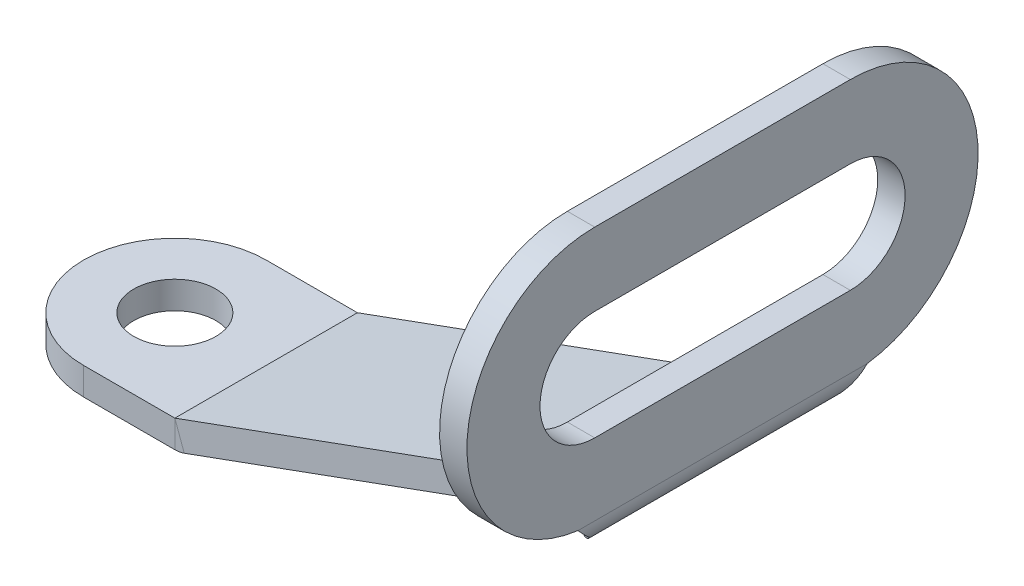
ISO-10303-21;
HEADER;
FILE_DESCRIPTION(('STEP AP214'),'2;1');
FILE_NAME('part.step','',(''),(''),'','','');
FILE_SCHEMA(('AUTOMOTIVE_DESIGN { 1 0 10303 214 1 1 1 1 }'));
ENDSEC;
DATA;
#1=APPLICATION_CONTEXT('core data for automotive mechanical design processes');
#2=APPLICATION_PROTOCOL_DEFINITION('international standard','automotive_design',2000,#1);
#3=PRODUCT_CONTEXT('',#1,'mechanical');
#4=PRODUCT('Part','Part','',(#3));
#5=PRODUCT_RELATED_PRODUCT_CATEGORY('part','',(#4));
#6=PRODUCT_DEFINITION_FORMATION('','',#4);
#7=PRODUCT_DEFINITION_CONTEXT('part definition',#1,'design');
#8=PRODUCT_DEFINITION('design','',#6,#7);
#9=PRODUCT_DEFINITION_SHAPE('','',#8);
#10=(LENGTH_UNIT() NAMED_UNIT(*) SI_UNIT(.MILLI.,.METRE.));
#11=(NAMED_UNIT(*) PLANE_ANGLE_UNIT() SI_UNIT($,.RADIAN.));
#12=(NAMED_UNIT(*) SI_UNIT($,.STERADIAN.) SOLID_ANGLE_UNIT());
#13=UNCERTAINTY_MEASURE_WITH_UNIT(LENGTH_MEASURE(1.E-05),#10,'distance_accuracy_value','');
#14=(GEOMETRIC_REPRESENTATION_CONTEXT(3) GLOBAL_UNCERTAINTY_ASSIGNED_CONTEXT((#13)) GLOBAL_UNIT_ASSIGNED_CONTEXT((#10,
#11,#12)) REPRESENTATION_CONTEXT('',''));
#15=CARTESIAN_POINT('',(0.,0.,0.));
#16=DIRECTION('',(0.,0.,1.));
#17=DIRECTION('',(1.,0.,0.));
#18=AXIS2_PLACEMENT_3D('',#15,#16,#17);
#19=CARTESIAN_POINT('',(27.1259588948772,7.95692408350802,-7.));
#20=DIRECTION('',(-0.342020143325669,0.939692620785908,0.));
#21=DIRECTION('',(0.,0.,1.));
#22=AXIS2_PLACEMENT_3D('',#19,#20,#21);
#23=PLANE('',#22);
#24=DIRECTION('',(0.939692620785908,0.342020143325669,0.));
#25=VECTOR('',#24,1.);
#26=CARTESIAN_POINT('',(0.81456551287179,-1.61963992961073,5.));
#27=LINE('',#26,#25);
#28=CARTESIAN_POINT('',(5.51319508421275,0.0905213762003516,5.));
#29=VERTEX_POINT('',#28);
#30=CARTESIAN_POINT('',(27.1259588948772,7.95692408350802,5.));
#31=VERTEX_POINT('',#30);
#32=EDGE_CURVE('E84',#29,#31,#27,.T.);
#33=ORIENTED_EDGE('',*,*,#32,.F.);
#34=DIRECTION('',(0.,0.,-1.));
#35=VECTOR('',#34,1.);
#36=CARTESIAN_POINT('',(5.51319508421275,0.0905213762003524,-7.));
#37=LINE('',#36,#35);
#38=CARTESIAN_POINT('',(5.51319508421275,0.090521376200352,-5.));
#39=VERTEX_POINT('',#38);
#40=EDGE_CURVE('E76',#29,#39,#37,.T.);
#41=ORIENTED_EDGE('',*,*,#40,.T.);
#42=DIRECTION('',(-0.939692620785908,-0.342020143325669,0.));
#43=VECTOR('',#42,1.);
#44=CARTESIAN_POINT('',(0.81456551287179,-1.61963992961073,-5.));
#45=LINE('',#44,#43);
#46=CARTESIAN_POINT('',(27.1259588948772,7.95692408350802,-5.));
#47=VERTEX_POINT('',#46);
#48=EDGE_CURVE('E91',#47,#39,#45,.T.);
#49=ORIENTED_EDGE('',*,*,#48,.F.);
#50=CARTESIAN_POINT('',(27.1259588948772,7.95692408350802,-7.));
#51=DIRECTION('',(0.342020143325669,-0.939692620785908,0.));
#52=DIRECTION('',(0.,0.,1.));
#53=AXIS2_PLACEMENT_3D('',#50,#51,#52);
#54=CIRCLE('',#53,2.);
#55=CARTESIAN_POINT('',(28.9479329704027,8.620068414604,-6.5094390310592));
#56=VERTEX_POINT('',#55);
#57=EDGE_CURVE('E883',#56,#47,#54,.T.);
#58=ORIENTED_EDGE('',*,*,#57,.F.);
#59=DIRECTION('',(0.,0.,-1.));
#60=VECTOR('',#59,1.);
#61=CARTESIAN_POINT('',(28.9479329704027,8.620068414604,-7.));
#62=LINE('',#61,#60);
#63=CARTESIAN_POINT('',(28.9479329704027,8.620068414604,6.5094390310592));
#64=VERTEX_POINT('',#63);
#65=EDGE_CURVE('E910',#64,#56,#62,.T.);
#66=ORIENTED_EDGE('',*,*,#65,.F.);
#67=CARTESIAN_POINT('',(27.1259588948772,7.95692408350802,7.));
#68=DIRECTION('',(0.342020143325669,-0.939692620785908,0.));
#69=DIRECTION('',(0.,0.,1.));
#70=AXIS2_PLACEMENT_3D('',#67,#68,#69);
#71=CIRCLE('',#70,2.);
#72=EDGE_CURVE('E947',#31,#64,#71,.T.);
#73=ORIENTED_EDGE('',*,*,#72,.F.);
#74=EDGE_LOOP('',(#33,#41,#49,#58,#66,#73));
#75=FACE_BOUND('',#74,.T.);
#76=ADVANCED_FACE('F67',(#75),#23,.F.);
#77=CARTESIAN_POINT('',(0.301535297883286,-0.210100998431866,-5.));
#78=DIRECTION('',(0.,0.,1.));
#79=DIRECTION('',(0.939692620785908,0.342020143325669,0.));
#80=AXIS2_PLACEMENT_3D('',#77,#78,#79);
#81=PLANE('',#80);
#82=ORIENTED_EDGE('',*,*,#48,.T.);
#83=DIRECTION('',(-0.342020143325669,0.939692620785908,0.));
#84=VECTOR('',#83,1.);
#85=CARTESIAN_POINT('',(5.00016486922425,1.50006030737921,-5.));
#86=LINE('',#85,#84);
#87=CARTESIAN_POINT('',(5.00016486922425,1.50006030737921,-5.));
#88=VERTEX_POINT('',#87);
#89=EDGE_CURVE('E498',#39,#88,#86,.T.);
#90=ORIENTED_EDGE('',*,*,#89,.T.);
#91=DIRECTION('',(-0.939692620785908,-0.342020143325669,0.));
#92=VECTOR('',#91,1.);
#93=CARTESIAN_POINT('',(0.301535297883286,-0.210100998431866,-5.));
#94=LINE('',#93,#92);
#95=CARTESIAN_POINT('',(26.6129286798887,9.36646301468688,-5.));
#96=VERTEX_POINT('',#95);
#97=EDGE_CURVE('E884',#96,#88,#94,.T.);
#98=ORIENTED_EDGE('',*,*,#97,.F.);
#99=DIRECTION('',(0.342020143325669,-0.939692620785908,0.));
#100=VECTOR('',#99,1.);
#101=CARTESIAN_POINT('',(26.6129286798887,9.36646301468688,-5.));
#102=LINE('',#101,#100);
#103=EDGE_CURVE('E893',#96,#47,#102,.T.);
#104=ORIENTED_EDGE('',*,*,#103,.T.);
#105=EDGE_LOOP('',(#82,#90,#98,#104));
#106=FACE_BOUND('',#105,.T.);
#107=ADVANCED_FACE('F556',(#106),#81,.F.);
#108=CARTESIAN_POINT('',(0.301535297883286,-0.210100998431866,5.));
#109=DIRECTION('',(0.,0.,-1.));
#110=DIRECTION('',(-0.939692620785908,-0.342020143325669,0.));
#111=AXIS2_PLACEMENT_3D('',#108,#109,#110);
#112=PLANE('',#111);
#113=DIRECTION('',(0.939692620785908,0.342020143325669,0.));
#114=VECTOR('',#113,1.);
#115=CARTESIAN_POINT('',(0.301535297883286,-0.210100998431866,5.));
#116=LINE('',#115,#114);
#117=CARTESIAN_POINT('',(5.00016486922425,1.50006030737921,5.));
#118=VERTEX_POINT('',#117);
#119=CARTESIAN_POINT('',(26.6129286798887,9.36646301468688,5.));
#120=VERTEX_POINT('',#119);
#121=EDGE_CURVE('E71',#118,#120,#116,.T.);
#122=ORIENTED_EDGE('',*,*,#121,.F.);
#123=DIRECTION('',(0.342020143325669,-0.939692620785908,0.));
#124=VECTOR('',#123,1.);
#125=CARTESIAN_POINT('',(5.00016486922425,1.50006030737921,5.));
#126=LINE('',#125,#124);
#127=EDGE_CURVE('E12',#118,#29,#126,.T.);
#128=ORIENTED_EDGE('',*,*,#127,.T.);
#129=ORIENTED_EDGE('',*,*,#32,.T.);
#130=DIRECTION('',(0.342020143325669,-0.939692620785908,0.));
#131=VECTOR('',#130,1.);
#132=CARTESIAN_POINT('',(26.6129286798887,9.36646301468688,5.));
#133=LINE('',#132,#131);
#134=EDGE_CURVE('E881',#120,#31,#133,.T.);
#135=ORIENTED_EDGE('',*,*,#134,.F.);
#136=EDGE_LOOP('',(#122,#128,#129,#135));
#137=FACE_BOUND('',#136,.T.);
#138=ADVANCED_FACE('F69',(#137),#112,.F.);
#139=CARTESIAN_POINT('',(28.5007007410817,17.0624809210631,-7.));
#140=DIRECTION('',(1.,0.,0.));
#141=DIRECTION('',(0.,0.,-1.));
#142=AXIS2_PLACEMENT_3D('',#139,#140,#141);
#143=CYLINDRICAL_SURFACE('',#142,7.);
#144=CARTESIAN_POINT('',(30.0007007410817,17.0624809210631,-7.));
#145=DIRECTION('',(-1.,0.,0.));
#146=DIRECTION('',(0.,0.,1.));
#147=AXIS2_PLACEMENT_3D('',#144,#145,#146);
#148=CIRCLE('',#147,7.);
#149=CARTESIAN_POINT('',(30.0007007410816,24.0624809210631,-7.));
#150=VERTEX_POINT('',#149);
#151=CARTESIAN_POINT('',(30.0007007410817,10.1235766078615,-7.92282551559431));
#152=VERTEX_POINT('',#151);
#153=EDGE_CURVE('E518',#150,#152,#148,.T.);
#154=ORIENTED_EDGE('',*,*,#153,.T.);
#155=CARTESIAN_POINT('',(28.5007007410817,10.1235766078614,-7.92282551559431));
#156=CARTESIAN_POINT('',(30.0007007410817,10.1235766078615,-7.92282551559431));
#157=B_SPLINE_CURVE_WITH_KNOTS('',1,(#155,#156),.UNSPECIFIED.,.F.,.F.,(2,2),(0.,1.),.UNSPECIFIED.);
#158=CARTESIAN_POINT('',(28.5007007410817,10.1235766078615,-7.92282551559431));
#159=VERTEX_POINT('',#158);
#160=EDGE_CURVE('E501',#152,#159,#157,.F.);
#161=ORIENTED_EDGE('',*,*,#160,.T.);
#162=CARTESIAN_POINT('',(28.5007007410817,17.0624809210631,-7.));
#163=DIRECTION('',(-1.,0.,0.));
#164=DIRECTION('',(0.,0.,1.));
#165=AXIS2_PLACEMENT_3D('',#162,#163,#164);
#166=CIRCLE('',#165,7.);
#167=CARTESIAN_POINT('',(28.5007007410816,24.0624809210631,-7.));
#168=VERTEX_POINT('',#167);
#169=EDGE_CURVE('E965',#168,#159,#166,.T.);
#170=ORIENTED_EDGE('',*,*,#169,.F.);
#171=DIRECTION('',(1.,0.,0.));
#172=VECTOR('',#171,1.);
#173=CARTESIAN_POINT('',(28.5007007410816,24.0624809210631,-7.));
#174=LINE('',#173,#172);
#175=EDGE_CURVE('E967',#168,#150,#174,.T.);
#176=ORIENTED_EDGE('',*,*,#175,.T.);
#177=EDGE_LOOP('',(#154,#161,#170,#176));
#178=FACE_BOUND('',#177,.T.);
#179=ADVANCED_FACE('F531',(#178),#143,.T.);
#180=CARTESIAN_POINT('',(28.5007007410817,17.0624809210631,7.));
#181=DIRECTION('',(1.,0.,0.));
#182=DIRECTION('',(0.,0.,-1.));
#183=AXIS2_PLACEMENT_3D('',#180,#181,#182);
#184=CYLINDRICAL_SURFACE('',#183,7.);
#185=CARTESIAN_POINT('',(28.5007007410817,17.0624809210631,7.));
#186=DIRECTION('',(-1.,0.,0.));
#187=DIRECTION('',(0.,0.,1.));
#188=AXIS2_PLACEMENT_3D('',#185,#186,#187);
#189=CIRCLE('',#188,7.);
#190=CARTESIAN_POINT('',(28.5007007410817,10.1235766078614,7.92282551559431));
#191=VERTEX_POINT('',#190);
#192=CARTESIAN_POINT('',(28.5007007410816,24.0624809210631,7.));
#193=VERTEX_POINT('',#192);
#194=EDGE_CURVE('E520',#191,#193,#189,.T.);
#195=ORIENTED_EDGE('',*,*,#194,.F.);
#196=CARTESIAN_POINT('',(30.0007007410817,10.1235766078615,7.9228255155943));
#197=CARTESIAN_POINT('',(28.5007007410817,10.1235766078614,7.9228255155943));
#198=B_SPLINE_CURVE_WITH_KNOTS('',1,(#196,#197),.UNSPECIFIED.,.F.,.F.,(2,2),(0.,1.),.UNSPECIFIED.);
#199=CARTESIAN_POINT('',(30.0007007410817,10.1235766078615,7.92282551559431));
#200=VERTEX_POINT('',#199);
#201=EDGE_CURVE('E485',#191,#200,#198,.F.);
#202=ORIENTED_EDGE('',*,*,#201,.T.);
#203=CARTESIAN_POINT('',(30.0007007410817,17.0624809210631,7.));
#204=DIRECTION('',(-1.,0.,0.));
#205=DIRECTION('',(0.,0.,1.));
#206=AXIS2_PLACEMENT_3D('',#203,#204,#205);
#207=CIRCLE('',#206,7.);
#208=CARTESIAN_POINT('',(30.0007007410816,24.0624809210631,7.));
#209=VERTEX_POINT('',#208);
#210=EDGE_CURVE('E512',#200,#209,#207,.T.);
#211=ORIENTED_EDGE('',*,*,#210,.T.);
#212=DIRECTION('',(1.,0.,0.));
#213=VECTOR('',#212,1.);
#214=CARTESIAN_POINT('',(28.5007007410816,24.0624809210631,7.));
#215=LINE('',#214,#213);
#216=EDGE_CURVE('E970',#193,#209,#215,.T.);
#217=ORIENTED_EDGE('',*,*,#216,.F.);
#218=EDGE_LOOP('',(#195,#202,#211,#217));
#219=FACE_BOUND('',#218,.T.);
#220=ADVANCED_FACE('F541',(#219),#184,.T.);
#221=CARTESIAN_POINT('',(30.0007007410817,8.06248092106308,-7.));
#222=DIRECTION('',(-1.,0.,0.));
#223=DIRECTION('',(0.,0.,1.));
#224=AXIS2_PLACEMENT_3D('',#221,#222,#223);
#225=PLANE('',#224);
#226=CARTESIAN_POINT('',(30.0007007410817,17.0624809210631,-7.));
#227=DIRECTION('',(-1.,0.,0.));
#228=DIRECTION('',(0.,0.,1.));
#229=AXIS2_PLACEMENT_3D('',#226,#227,#228);
#230=CIRCLE('',#229,3.);
#231=CARTESIAN_POINT('',(30.0007007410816,20.0624809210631,-7.));
#232=VERTEX_POINT('',#231);
#233=CARTESIAN_POINT('',(30.0007007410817,14.0624809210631,-7.));
#234=VERTEX_POINT('',#233);
#235=EDGE_CURVE('E943',#232,#234,#230,.T.);
#236=ORIENTED_EDGE('',*,*,#235,.T.);
#237=DIRECTION('',(0.,0.,1.));
#238=VECTOR('',#237,1.);
#239=CARTESIAN_POINT('',(30.0007007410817,14.0624809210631,-7.));
#240=LINE('',#239,#238);
#241=CARTESIAN_POINT('',(30.0007007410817,14.0624809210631,7.));
#242=VERTEX_POINT('',#241);
#243=EDGE_CURVE('E946',#234,#242,#240,.T.);
#244=ORIENTED_EDGE('',*,*,#243,.T.);
#245=CARTESIAN_POINT('',(30.0007007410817,17.0624809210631,7.));
#246=DIRECTION('',(-1.,0.,0.));
#247=DIRECTION('',(0.,0.,1.));
#248=AXIS2_PLACEMENT_3D('',#245,#246,#247);
#249=CIRCLE('',#248,3.);
#250=CARTESIAN_POINT('',(30.0007007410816,20.0624809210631,7.));
#251=VERTEX_POINT('',#250);
#252=EDGE_CURVE('E950',#242,#251,#249,.T.);
#253=ORIENTED_EDGE('',*,*,#252,.T.);
#254=DIRECTION('',(0.,0.,-1.));
#255=VECTOR('',#254,1.);
#256=CARTESIAN_POINT('',(30.0007007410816,20.0624809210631,-7.));
#257=LINE('',#256,#255);
#258=EDGE_CURVE('E935',#251,#232,#257,.T.);
#259=ORIENTED_EDGE('',*,*,#258,.T.);
#260=EDGE_LOOP('',(#236,#244,#253,#259));
#261=FACE_BOUND('',#260,.T.);
#262=ORIENTED_EDGE('',*,*,#210,.F.);
#263=DIRECTION('',(0.,0.,-1.));
#264=VECTOR('',#263,1.);
#265=CARTESIAN_POINT('',(30.0007007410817,10.1235766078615,-7.));
#266=LINE('',#265,#264);
#267=EDGE_CURVE('E497',#200,#152,#266,.T.);
#268=ORIENTED_EDGE('',*,*,#267,.T.);
#269=ORIENTED_EDGE('',*,*,#153,.F.);
#270=DIRECTION('',(0.,0.,-1.));
#271=VECTOR('',#270,1.);
#272=CARTESIAN_POINT('',(30.0007007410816,24.0624809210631,-7.));
#273=LINE('',#272,#271);
#274=EDGE_CURVE('E514',#209,#150,#273,.T.);
#275=ORIENTED_EDGE('',*,*,#274,.F.);
#276=EDGE_LOOP('',(#262,#268,#269,#275));
#277=FACE_BOUND('',#276,.T.);
#278=ADVANCED_FACE('F544',(#261,#277),#225,.F.);
#279=CARTESIAN_POINT('',(28.5007007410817,8.06248092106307,-7.));
#280=DIRECTION('',(-1.,0.,0.));
#281=DIRECTION('',(0.,0.,1.));
#282=AXIS2_PLACEMENT_3D('',#279,#280,#281);
#283=PLANE('',#282);
#284=DIRECTION('',(0.,0.,-1.));
#285=VECTOR('',#284,1.);
#286=CARTESIAN_POINT('',(28.5007007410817,10.1235766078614,-7.));
#287=LINE('',#286,#285);
#288=EDGE_CURVE('E322',#191,#159,#287,.T.);
#289=ORIENTED_EDGE('',*,*,#288,.F.);
#290=ORIENTED_EDGE('',*,*,#194,.T.);
#291=DIRECTION('',(0.,0.,-1.));
#292=VECTOR('',#291,1.);
#293=CARTESIAN_POINT('',(28.5007007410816,24.0624809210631,-7.));
#294=LINE('',#293,#292);
#295=EDGE_CURVE('E963',#193,#168,#294,.T.);
#296=ORIENTED_EDGE('',*,*,#295,.T.);
#297=ORIENTED_EDGE('',*,*,#169,.T.);
#298=EDGE_LOOP('',(#289,#290,#296,#297));
#299=FACE_BOUND('',#298,.T.);
#300=DIRECTION('',(0.,0.,1.));
#301=VECTOR('',#300,1.);
#302=CARTESIAN_POINT('',(28.5007007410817,14.0624809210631,-7.));
#303=LINE('',#302,#301);
#304=CARTESIAN_POINT('',(28.5007007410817,14.0624809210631,-7.));
#305=VERTEX_POINT('',#304);
#306=CARTESIAN_POINT('',(28.5007007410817,14.0624809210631,7.));
#307=VERTEX_POINT('',#306);
#308=EDGE_CURVE('E934',#305,#307,#303,.T.);
#309=ORIENTED_EDGE('',*,*,#308,.F.);
#310=CARTESIAN_POINT('',(28.5007007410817,17.0624809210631,-7.));
#311=DIRECTION('',(-1.,0.,0.));
#312=DIRECTION('',(0.,0.,1.));
#313=AXIS2_PLACEMENT_3D('',#310,#311,#312);
#314=CIRCLE('',#313,3.);
#315=CARTESIAN_POINT('',(28.5007007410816,20.0624809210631,-7.));
#316=VERTEX_POINT('',#315);
#317=EDGE_CURVE('E932',#316,#305,#314,.T.);
#318=ORIENTED_EDGE('',*,*,#317,.F.);
#319=DIRECTION('',(0.,0.,-1.));
#320=VECTOR('',#319,1.);
#321=CARTESIAN_POINT('',(28.5007007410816,20.0624809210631,-7.));
#322=LINE('',#321,#320);
#323=CARTESIAN_POINT('',(28.5007007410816,20.0624809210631,7.));
#324=VERTEX_POINT('',#323);
#325=EDGE_CURVE('E940',#324,#316,#322,.T.);
#326=ORIENTED_EDGE('',*,*,#325,.F.);
#327=CARTESIAN_POINT('',(28.5007007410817,17.0624809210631,7.));
#328=DIRECTION('',(-1.,0.,0.));
#329=DIRECTION('',(0.,0.,1.));
#330=AXIS2_PLACEMENT_3D('',#327,#328,#329);
#331=CIRCLE('',#330,3.);
#332=EDGE_CURVE('E937',#307,#324,#331,.T.);
#333=ORIENTED_EDGE('',*,*,#332,.F.);
#334=EDGE_LOOP('',(#309,#318,#326,#333));
#335=FACE_BOUND('',#334,.T.);
#336=ADVANCED_FACE('F542',(#299,#335),#283,.T.);
#337=CARTESIAN_POINT('',(28.5007007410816,24.0624809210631,-7.));
#338=DIRECTION('',(0.,-1.,0.));
#339=DIRECTION('',(0.,0.,1.));
#340=AXIS2_PLACEMENT_3D('',#337,#338,#339);
#341=PLANE('',#340);
#342=ORIENTED_EDGE('',*,*,#274,.T.);
#343=ORIENTED_EDGE('',*,*,#175,.F.);
#344=ORIENTED_EDGE('',*,*,#295,.F.);
#345=ORIENTED_EDGE('',*,*,#216,.T.);
#346=EDGE_LOOP('',(#342,#343,#344,#345));
#347=FACE_BOUND('',#346,.T.);
#348=ADVANCED_FACE('F589',(#347),#341,.F.);
#349=CARTESIAN_POINT('',(28.5007007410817,17.0624809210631,-7.));
#350=DIRECTION('',(1.,0.,0.));
#351=DIRECTION('',(0.,0.,-1.));
#352=AXIS2_PLACEMENT_3D('',#349,#350,#351);
#353=CYLINDRICAL_SURFACE('',#352,3.);
#354=ORIENTED_EDGE('',*,*,#235,.F.);
#355=DIRECTION('',(1.,0.,0.));
#356=VECTOR('',#355,1.);
#357=CARTESIAN_POINT('',(28.5007007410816,20.0624809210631,-7.));
#358=LINE('',#357,#356);
#359=EDGE_CURVE('E942',#316,#232,#358,.T.);
#360=ORIENTED_EDGE('',*,*,#359,.F.);
#361=ORIENTED_EDGE('',*,*,#317,.T.);
#362=DIRECTION('',(1.,0.,0.));
#363=VECTOR('',#362,1.);
#364=CARTESIAN_POINT('',(28.5007007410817,14.0624809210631,-7.));
#365=LINE('',#364,#363);
#366=EDGE_CURVE('E515',#305,#234,#365,.T.);
#367=ORIENTED_EDGE('',*,*,#366,.T.);
#368=EDGE_LOOP('',(#354,#360,#361,#367));
#369=FACE_BOUND('',#368,.T.);
#370=ADVANCED_FACE('F596',(#369),#353,.F.);
#371=CARTESIAN_POINT('',(28.5007007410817,14.0624809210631,-7.));
#372=DIRECTION('',(0.,1.,0.));
#373=DIRECTION('',(0.,0.,-1.));
#374=AXIS2_PLACEMENT_3D('',#371,#372,#373);
#375=PLANE('',#374);
#376=ORIENTED_EDGE('',*,*,#243,.F.);
#377=ORIENTED_EDGE('',*,*,#366,.F.);
#378=ORIENTED_EDGE('',*,*,#308,.T.);
#379=DIRECTION('',(1.,0.,0.));
#380=VECTOR('',#379,1.);
#381=CARTESIAN_POINT('',(28.5007007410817,14.0624809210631,7.));
#382=LINE('',#381,#380);
#383=EDGE_CURVE('E959',#307,#242,#382,.T.);
#384=ORIENTED_EDGE('',*,*,#383,.T.);
#385=EDGE_LOOP('',(#376,#377,#378,#384));
#386=FACE_BOUND('',#385,.T.);
#387=ADVANCED_FACE('F603',(#386),#375,.T.);
#388=CARTESIAN_POINT('',(28.5007007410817,17.0624809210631,7.));
#389=DIRECTION('',(1.,0.,0.));
#390=DIRECTION('',(0.,0.,-1.));
#391=AXIS2_PLACEMENT_3D('',#388,#389,#390);
#392=CYLINDRICAL_SURFACE('',#391,3.);
#393=ORIENTED_EDGE('',*,*,#252,.F.);
#394=ORIENTED_EDGE('',*,*,#383,.F.);
#395=ORIENTED_EDGE('',*,*,#332,.T.);
#396=DIRECTION('',(1.,0.,0.));
#397=VECTOR('',#396,1.);
#398=CARTESIAN_POINT('',(28.5007007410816,20.0624809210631,7.));
#399=LINE('',#398,#397);
#400=EDGE_CURVE('E957',#324,#251,#399,.T.);
#401=ORIENTED_EDGE('',*,*,#400,.T.);
#402=EDGE_LOOP('',(#393,#394,#395,#401));
#403=FACE_BOUND('',#402,.T.);
#404=ADVANCED_FACE('F611',(#403),#392,.F.);
#405=CARTESIAN_POINT('',(28.5007007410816,20.0624809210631,-7.));
#406=DIRECTION('',(0.,-1.,0.));
#407=DIRECTION('',(0.,0.,1.));
#408=AXIS2_PLACEMENT_3D('',#405,#406,#407);
#409=PLANE('',#408);
#410=ORIENTED_EDGE('',*,*,#258,.F.);
#411=ORIENTED_EDGE('',*,*,#400,.F.);
#412=ORIENTED_EDGE('',*,*,#325,.T.);
#413=ORIENTED_EDGE('',*,*,#359,.T.);
#414=EDGE_LOOP('',(#410,#411,#412,#413));
#415=FACE_BOUND('',#414,.T.);
#416=ADVANCED_FACE('F554',(#415),#409,.T.);
#417=CARTESIAN_POINT('',(26.6129286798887,9.36646301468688,-7.));
#418=DIRECTION('',(-0.342020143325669,0.939692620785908,0.));
#419=DIRECTION('',(0.,0.,1.));
#420=AXIS2_PLACEMENT_3D('',#417,#418,#419);
#421=PLANE('',#420);
#422=DIRECTION('',(0.,0.,-1.));
#423=VECTOR('',#422,1.);
#424=CARTESIAN_POINT('',(5.00016486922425,1.50006030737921,-7.));
#425=LINE('',#424,#423);
#426=EDGE_CURVE('E242',#118,#88,#425,.T.);
#427=ORIENTED_EDGE('',*,*,#426,.F.);
#428=ORIENTED_EDGE('',*,*,#121,.T.);
#429=CARTESIAN_POINT('',(26.6129286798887,9.36646301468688,7.));
#430=DIRECTION('',(0.342020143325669,-0.939692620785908,0.));
#431=DIRECTION('',(0.,0.,1.));
#432=AXIS2_PLACEMENT_3D('',#429,#430,#431);
#433=CIRCLE('',#432,2.);
#434=CARTESIAN_POINT('',(28.4349027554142,10.0296073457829,6.5094390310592));
#435=VERTEX_POINT('',#434);
#436=EDGE_CURVE('E896',#120,#435,#433,.T.);
#437=ORIENTED_EDGE('',*,*,#436,.T.);
#438=DIRECTION('',(0.,0.,-1.));
#439=VECTOR('',#438,1.);
#440=CARTESIAN_POINT('',(28.4349027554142,10.0296073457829,-7.));
#441=LINE('',#440,#439);
#442=CARTESIAN_POINT('',(28.4349027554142,10.0296073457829,-6.5094390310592));
#443=VERTEX_POINT('',#442);
#444=EDGE_CURVE('E889',#435,#443,#441,.T.);
#445=ORIENTED_EDGE('',*,*,#444,.T.);
#446=CARTESIAN_POINT('',(26.6129286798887,9.36646301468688,-7.));
#447=DIRECTION('',(0.342020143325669,-0.939692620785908,0.));
#448=DIRECTION('',(0.,0.,1.));
#449=AXIS2_PLACEMENT_3D('',#446,#447,#448);
#450=CIRCLE('',#449,2.);
#451=EDGE_CURVE('E887',#443,#96,#450,.T.);
#452=ORIENTED_EDGE('',*,*,#451,.T.);
#453=ORIENTED_EDGE('',*,*,#97,.T.);
#454=EDGE_LOOP('',(#427,#428,#437,#445,#452,#453));
#455=FACE_BOUND('',#454,.T.);
#456=ADVANCED_FACE('F550',(#455),#421,.T.);
#457=CARTESIAN_POINT('',(26.6129286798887,9.36646301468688,-7.));
#458=DIRECTION('',(0.342020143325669,-0.939692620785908,0.));
#459=DIRECTION('',(0.,0.,-1.));
#460=AXIS2_PLACEMENT_3D('',#457,#458,#459);
#461=CYLINDRICAL_SURFACE('',#460,2.);
#462=CARTESIAN_POINT('',(28.9479329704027,8.620068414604,-6.5094390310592));
#463=CARTESIAN_POINT('',(28.4349027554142,10.0296073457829,-6.5094390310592));
#464=B_SPLINE_CURVE_WITH_KNOTS('',1,(#462,#463),.UNSPECIFIED.,.F.,.F.,(2,2),(0.,1.),.UNSPECIFIED.);
#465=EDGE_CURVE('E437',#56,#443,#464,.T.);
#466=ORIENTED_EDGE('',*,*,#465,.F.);
#467=ORIENTED_EDGE('',*,*,#57,.T.);
#468=ORIENTED_EDGE('',*,*,#103,.F.);
#469=ORIENTED_EDGE('',*,*,#451,.F.);
#470=EDGE_LOOP('',(#466,#467,#468,#469));
#471=FACE_BOUND('',#470,.T.);
#472=ADVANCED_FACE('F553',(#471),#461,.F.);
#473=CARTESIAN_POINT('',(26.6129286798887,9.36646301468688,7.));
#474=DIRECTION('',(0.342020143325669,-0.939692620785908,0.));
#475=DIRECTION('',(0.,0.,-1.));
#476=AXIS2_PLACEMENT_3D('',#473,#474,#475);
#477=CYLINDRICAL_SURFACE('',#476,2.);
#478=CARTESIAN_POINT('',(28.4349027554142,10.0296073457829,6.5094390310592));
#479=CARTESIAN_POINT('',(28.9479329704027,8.620068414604,6.5094390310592));
#480=B_SPLINE_CURVE_WITH_KNOTS('',1,(#478,#479),.UNSPECIFIED.,.F.,.F.,(2,2),(0.,1.),.UNSPECIFIED.);
#481=EDGE_CURVE('E363',#435,#64,#480,.T.);
#482=ORIENTED_EDGE('',*,*,#481,.F.);
#483=ORIENTED_EDGE('',*,*,#436,.F.);
#484=ORIENTED_EDGE('',*,*,#134,.T.);
#485=ORIENTED_EDGE('',*,*,#72,.T.);
#486=EDGE_LOOP('',(#482,#483,#484,#485));
#487=FACE_BOUND('',#486,.T.);
#488=ADVANCED_FACE('F391',(#487),#477,.F.);
#489=CARTESIAN_POINT('',(28.9479329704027,8.620068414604,6.5094390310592));
#490=CARTESIAN_POINT('',(29.254793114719,8.73175637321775,6.6733402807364));
#491=CARTESIAN_POINT('',(29.5240404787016,8.93835714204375,6.8360987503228));
#492=CARTESIAN_POINT('',(29.7113440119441,9.20585430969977,7.));
#493=CARTESIAN_POINT('',(28.4349027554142,10.0296073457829,6.5094390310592));
#494=CARTESIAN_POINT('',(28.4540381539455,10.0365720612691,6.67296972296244));
#495=CARTESIAN_POINT('',(28.4709359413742,10.0495381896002,6.83646930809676));
#496=CARTESIAN_POINT('',(28.4826159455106,10.0662189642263,7.));
#497=B_SPLINE_SURFACE_WITH_KNOTS('',1,3,((#489,#490,#491,#492),(#493,#494,#495,#496)),
.UNSPECIFIED.,.F.,.F.,.F.,(2,2),(4,4),(0.,1.),(0.,1.),.UNSPECIFIED.);
#498=CARTESIAN_POINT('',(28.9479329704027,8.620068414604,6.5094390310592));
#499=CARTESIAN_POINT('',(29.254793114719,8.73175637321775,6.6733402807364));
#500=CARTESIAN_POINT('',(29.5240404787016,8.93835714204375,6.8360987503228));
#501=CARTESIAN_POINT('',(29.7113440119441,9.20585430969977,7.));
#502=B_SPLINE_CURVE_WITH_KNOTS('',3,(#498,#499,#500,#501),.UNSPECIFIED.,.F.,.F.,(4,4),(0.,1.),.UNSPECIFIED.);
#503=CARTESIAN_POINT('',(29.7113433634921,9.20585338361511,6.99999943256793));
#504=VERTEX_POINT('',#503);
#505=EDGE_CURVE('E256',#64,#504,#502,.T.);
#506=CARTESIAN_POINT('',(29.7113440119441,9.20585430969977,7.));
#507=CARTESIAN_POINT('',(28.4826159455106,10.0662189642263,7.));
#508=B_SPLINE_CURVE_WITH_KNOTS('',1,(#506,#507),.UNSPECIFIED.,.F.,.F.,(2,2),(0.,1.),.UNSPECIFIED.);
#509=CARTESIAN_POINT('',(28.4826159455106,10.0662189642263,7.));
#510=VERTEX_POINT('',#509);
#511=EDGE_CURVE('E360',#504,#510,#508,.T.);
#512=CARTESIAN_POINT('',(28.4826159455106,10.0662189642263,7.));
#513=CARTESIAN_POINT('',(28.4709359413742,10.0495381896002,6.83646930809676));
#514=CARTESIAN_POINT('',(28.4540381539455,10.0365720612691,6.67296972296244));
#515=CARTESIAN_POINT('',(28.4349027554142,10.0296073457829,6.5094390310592));
#516=B_SPLINE_CURVE_WITH_KNOTS('',3,(#512,#513,#514,#515),.UNSPECIFIED.,.F.,.F.,(4,4),(0.,1.),.UNSPECIFIED.);
#517=EDGE_CURVE('E326',#435,#510,#516,.F.);
#518=ORIENTED_EDGE('',*,*,#481,.T.);
#519=ORIENTED_EDGE('',*,*,#505,.T.);
#520=ORIENTED_EDGE('',*,*,#511,.T.);
#521=ORIENTED_EDGE('',*,*,#517,.F.);
#522=EDGE_LOOP('',(#518,#519,#520,#521));
#523=FACE_BOUND('',#522,.T.);
#524=ADVANCED_FACE('F359',(#523),#497,.F.);
#525=CARTESIAN_POINT('',(29.7113440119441,9.20585430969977,7.));
#526=CARTESIAN_POINT('',(29.898533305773,9.47318832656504,7.30813703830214));
#527=CARTESIAN_POINT('',(30.0007007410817,9.79722203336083,7.61468847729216));
#528=CARTESIAN_POINT('',(30.0007007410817,10.1235766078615,7.9228255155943));
#529=CARTESIAN_POINT('',(28.4826159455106,10.0662189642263,7.));
#530=CARTESIAN_POINT('',(28.4942954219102,10.0828989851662,7.30761411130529));
#531=CARTESIAN_POINT('',(28.5007007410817,10.103214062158,7.61521140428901));
#532=CARTESIAN_POINT('',(28.5007007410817,10.1235766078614,7.9228255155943));
#533=B_SPLINE_SURFACE_WITH_KNOTS('',1,3,((#525,#526,#527,#528),(#529,#530,#531,#532)),
.UNSPECIFIED.,.F.,.F.,.F.,(2,2),(4,4),(0.,1.),(0.,1.),.UNSPECIFIED.);
#534=CARTESIAN_POINT('',(29.7113440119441,9.20585430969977,7.));
#535=CARTESIAN_POINT('',(29.898533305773,9.47318832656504,7.30813703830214));
#536=CARTESIAN_POINT('',(30.0007007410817,9.79722203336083,7.61468847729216));
#537=CARTESIAN_POINT('',(30.0007007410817,10.1235766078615,7.9228255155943));
#538=B_SPLINE_CURVE_WITH_KNOTS('',3,(#534,#535,#536,#537),.UNSPECIFIED.,.F.,.F.,(4,4),(0.,1.),.UNSPECIFIED.);
#539=EDGE_CURVE('E347',#504,#200,#538,.T.);
#540=CARTESIAN_POINT('',(28.5007007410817,10.1235766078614,7.9228255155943));
#541=CARTESIAN_POINT('',(28.5007007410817,10.103214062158,7.61521140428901));
#542=CARTESIAN_POINT('',(28.4942954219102,10.0828989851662,7.30761411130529));
#543=CARTESIAN_POINT('',(28.4826159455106,10.0662189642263,7.));
#544=B_SPLINE_CURVE_WITH_KNOTS('',3,(#540,#541,#542,#543),.UNSPECIFIED.,.F.,.F.,(4,4),(0.,1.),.UNSPECIFIED.);
#545=EDGE_CURVE('E321',#510,#191,#544,.F.);
#546=ORIENTED_EDGE('',*,*,#511,.F.);
#547=ORIENTED_EDGE('',*,*,#539,.T.);
#548=ORIENTED_EDGE('',*,*,#201,.F.);
#549=ORIENTED_EDGE('',*,*,#545,.F.);
#550=EDGE_LOOP('',(#546,#547,#548,#549));
#551=FACE_BOUND('',#550,.T.);
#552=ADVANCED_FACE('F390',(#551),#533,.F.);
#553=CARTESIAN_POINT('',(30.0007007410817,10.1235766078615,-7.92282551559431));
#554=CARTESIAN_POINT('',(30.0007007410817,9.79722203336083,-7.61468847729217));
#555=CARTESIAN_POINT('',(29.898533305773,9.47318832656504,-7.30813703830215));
#556=CARTESIAN_POINT('',(29.7113440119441,9.20585430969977,-7.));
#557=CARTESIAN_POINT('',(28.5007007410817,10.1235766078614,-7.92282551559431));
#558=CARTESIAN_POINT('',(28.5007007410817,10.103214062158,-7.61521140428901));
#559=CARTESIAN_POINT('',(28.4942954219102,10.0828989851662,-7.3076141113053));
#560=CARTESIAN_POINT('',(28.4826159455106,10.0662189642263,-7.));
#561=B_SPLINE_SURFACE_WITH_KNOTS('',1,3,((#553,#554,#555,#556),(#557,#558,#559,#560)),
.UNSPECIFIED.,.F.,.F.,.F.,(2,2),(4,4),(0.,1.),(0.,1.),.UNSPECIFIED.);
#562=CARTESIAN_POINT('',(30.0007007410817,10.1235766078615,-7.92282551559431));
#563=CARTESIAN_POINT('',(30.0007007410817,9.79722203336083,-7.61468847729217));
#564=CARTESIAN_POINT('',(29.898533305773,9.47318832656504,-7.30813703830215));
#565=CARTESIAN_POINT('',(29.7113440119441,9.20585430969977,-7.));
#566=B_SPLINE_CURVE_WITH_KNOTS('',3,(#562,#563,#564,#565),.UNSPECIFIED.,.F.,.F.,(4,4),(0.,1.),.UNSPECIFIED.);
#567=CARTESIAN_POINT('',(29.7113446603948,9.20585523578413,-7.00000106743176));
#568=VERTEX_POINT('',#567);
#569=EDGE_CURVE('E341',#152,#568,#566,.T.);
#570=CARTESIAN_POINT('',(29.7113440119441,9.20585430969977,-7.));
#571=CARTESIAN_POINT('',(28.4826159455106,10.0662189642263,-7.));
#572=B_SPLINE_CURVE_WITH_KNOTS('',1,(#570,#571),.UNSPECIFIED.,.F.,.F.,(2,2),(0.,1.),.UNSPECIFIED.);
#573=CARTESIAN_POINT('',(28.4826159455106,10.0662189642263,-7.));
#574=VERTEX_POINT('',#573);
#575=EDGE_CURVE('E447',#568,#574,#572,.T.);
#576=CARTESIAN_POINT('',(28.4826159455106,10.0662189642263,-7.));
#577=CARTESIAN_POINT('',(28.4942954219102,10.0828989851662,-7.3076141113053));
#578=CARTESIAN_POINT('',(28.5007007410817,10.103214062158,-7.61521140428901));
#579=CARTESIAN_POINT('',(28.5007007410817,10.1235766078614,-7.92282551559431));
#580=B_SPLINE_CURVE_WITH_KNOTS('',3,(#576,#577,#578,#579),.UNSPECIFIED.,.F.,.F.,(4,4),(0.,1.),.UNSPECIFIED.);
#581=EDGE_CURVE('E332',#159,#574,#580,.F.);
#582=ORIENTED_EDGE('',*,*,#160,.F.);
#583=ORIENTED_EDGE('',*,*,#569,.T.);
#584=ORIENTED_EDGE('',*,*,#575,.T.);
#585=ORIENTED_EDGE('',*,*,#581,.F.);
#586=EDGE_LOOP('',(#582,#583,#584,#585));
#587=FACE_BOUND('',#586,.T.);
#588=ADVANCED_FACE('F292',(#587),#561,.F.);
#589=CARTESIAN_POINT('',(29.7113440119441,9.20585430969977,-7.));
#590=CARTESIAN_POINT('',(29.5240404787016,8.93835714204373,-6.83609875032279));
#591=CARTESIAN_POINT('',(29.254793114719,8.73175637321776,-6.67334028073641));
#592=CARTESIAN_POINT('',(28.9479329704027,8.620068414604,-6.5094390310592));
#593=CARTESIAN_POINT('',(28.4826159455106,10.0662189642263,-7.));
#594=CARTESIAN_POINT('',(28.4709359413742,10.0495381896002,-6.83646930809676));
#595=CARTESIAN_POINT('',(28.4540381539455,10.0365720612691,-6.67296972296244));
#596=CARTESIAN_POINT('',(28.4349027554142,10.0296073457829,-6.5094390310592));
#597=B_SPLINE_SURFACE_WITH_KNOTS('',1,3,((#589,#590,#591,#592),(#593,#594,#595,#596)),
.UNSPECIFIED.,.F.,.F.,.F.,(2,2),(4,4),(0.,1.),(0.,1.),.UNSPECIFIED.);
#598=CARTESIAN_POINT('',(29.7113440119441,9.20585430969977,-7.));
#599=CARTESIAN_POINT('',(29.5240404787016,8.93835714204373,-6.83609875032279));
#600=CARTESIAN_POINT('',(29.254793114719,8.73175637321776,-6.67334028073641));
#601=CARTESIAN_POINT('',(28.9479329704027,8.620068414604,-6.5094390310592));
#602=B_SPLINE_CURVE_WITH_KNOTS('',3,(#598,#599,#600,#601),.UNSPECIFIED.,.F.,.F.,(4,4),(0.,1.),.UNSPECIFIED.);
#603=EDGE_CURVE('E337',#568,#56,#602,.T.);
#604=CARTESIAN_POINT('',(28.4349027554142,10.0296073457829,-6.5094390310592));
#605=CARTESIAN_POINT('',(28.4540381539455,10.0365720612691,-6.67296972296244));
#606=CARTESIAN_POINT('',(28.4709359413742,10.0495381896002,-6.83646930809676));
#607=CARTESIAN_POINT('',(28.4826159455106,10.0662189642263,-7.));
#608=B_SPLINE_CURVE_WITH_KNOTS('',3,(#604,#605,#606,#607),.UNSPECIFIED.,.F.,.F.,(4,4),(0.,1.),.UNSPECIFIED.);
#609=EDGE_CURVE('E336',#574,#443,#608,.F.);
#610=ORIENTED_EDGE('',*,*,#603,.T.);
#611=ORIENTED_EDGE('',*,*,#465,.T.);
#612=ORIENTED_EDGE('',*,*,#609,.F.);
#613=ORIENTED_EDGE('',*,*,#575,.F.);
#614=EDGE_LOOP('',(#610,#611,#612,#613));
#615=FACE_BOUND('',#614,.T.);
#616=ADVANCED_FACE('F290',(#615),#597,.F.);
#617=CARTESIAN_POINT('',(28.4007007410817,10.1235766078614,15.9169591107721));
#618=DIRECTION('',(0.,0.,-1.));
#619=DIRECTION('',(-0.939692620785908,-0.342020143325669,0.));
#620=AXIS2_PLACEMENT_3D('',#617,#618,#619);
#621=CYLINDRICAL_SURFACE('',#620,0.1);
#622=ORIENTED_EDGE('',*,*,#581,.T.);
#623=ORIENTED_EDGE('',*,*,#609,.T.);
#624=ORIENTED_EDGE('',*,*,#444,.F.);
#625=ORIENTED_EDGE('',*,*,#517,.T.);
#626=ORIENTED_EDGE('',*,*,#545,.T.);
#627=ORIENTED_EDGE('',*,*,#288,.T.);
#628=EDGE_LOOP('',(#622,#623,#624,#625,#626,#627));
#629=FACE_BOUND('',#628,.T.);
#630=ADVANCED_FACE('F279',(#629),#621,.F.);
#631=CARTESIAN_POINT('',(28.4007007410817,10.1235766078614,15.9169591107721));
#632=DIRECTION('',(0.,0.,-1.));
#633=DIRECTION('',(-0.939692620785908,-0.342020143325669,0.));
#634=AXIS2_PLACEMENT_3D('',#631,#632,#633);
#635=CYLINDRICAL_SURFACE('',#634,1.6);
#636=ORIENTED_EDGE('',*,*,#569,.F.);
#637=ORIENTED_EDGE('',*,*,#267,.F.);
#638=ORIENTED_EDGE('',*,*,#539,.F.);
#639=ORIENTED_EDGE('',*,*,#505,.F.);
#640=ORIENTED_EDGE('',*,*,#65,.T.);
#641=ORIENTED_EDGE('',*,*,#603,.F.);
#642=EDGE_LOOP('',(#636,#637,#638,#639,#640,#641));
#643=FACE_BOUND('',#642,.T.);
#644=ADVANCED_FACE('F289',(#643),#635,.T.);
#645=CARTESIAN_POINT('',(0.,1.5,0.));
#646=DIRECTION('',(0.,-1.,0.));
#647=DIRECTION('',(0.,0.,-1.));
#648=AXIS2_PLACEMENT_3D('',#645,#646,#647);
#649=CYLINDRICAL_SURFACE('',#648,5.);
#650=CARTESIAN_POINT('',(0.,0.,0.));
#651=DIRECTION('',(0.,1.,0.));
#652=DIRECTION('',(0.,0.,1.));
#653=AXIS2_PLACEMENT_3D('',#650,#651,#652);
#654=CIRCLE('',#653,5.);
#655=CARTESIAN_POINT('',(0.,0.,-5.));
#656=VERTEX_POINT('',#655);
#657=CARTESIAN_POINT('',(0.,0.,5.));
#658=VERTEX_POINT('',#657);
#659=EDGE_CURVE('E237',#656,#658,#654,.T.);
#660=ORIENTED_EDGE('',*,*,#659,.T.);
#661=DIRECTION('',(0.,-1.,0.));
#662=VECTOR('',#661,1.);
#663=CARTESIAN_POINT('',(0.,1.5,5.));
#664=LINE('',#663,#662);
#665=CARTESIAN_POINT('',(0.,1.5,5.));
#666=VERTEX_POINT('',#665);
#667=EDGE_CURVE('E257',#666,#658,#664,.T.);
#668=ORIENTED_EDGE('',*,*,#667,.F.);
#669=CARTESIAN_POINT('',(0.,1.5,0.));
#670=DIRECTION('',(0.,1.,0.));
#671=DIRECTION('',(0.,0.,1.));
#672=AXIS2_PLACEMENT_3D('',#669,#670,#671);
#673=CIRCLE('',#672,5.);
#674=CARTESIAN_POINT('',(0.,1.5,-5.));
#675=VERTEX_POINT('',#674);
#676=EDGE_CURVE('E216',#675,#666,#673,.T.);
#677=ORIENTED_EDGE('',*,*,#676,.F.);
#678=DIRECTION('',(0.,-1.,0.));
#679=VECTOR('',#678,1.);
#680=CARTESIAN_POINT('',(0.,1.5,-5.));
#681=LINE('',#680,#679);
#682=EDGE_CURVE('E213',#675,#656,#681,.T.);
#683=ORIENTED_EDGE('',*,*,#682,.T.);
#684=EDGE_LOOP('',(#660,#668,#677,#683));
#685=FACE_BOUND('',#684,.T.);
#686=ADVANCED_FACE('F672',(#685),#649,.T.);
#687=CARTESIAN_POINT('',(0.,1.5,0.));
#688=DIRECTION('',(0.,-1.,0.));
#689=DIRECTION('',(0.,0.,-1.));
#690=AXIS2_PLACEMENT_3D('',#687,#688,#689);
#691=CYLINDRICAL_SURFACE('',#690,2.25);
#692=CARTESIAN_POINT('',(0.,1.5,0.));
#693=DIRECTION('',(0.,1.,0.));
#694=DIRECTION('',(0.,0.,1.));
#695=AXIS2_PLACEMENT_3D('',#692,#693,#694);
#696=CIRCLE('',#695,2.25);
#697=CARTESIAN_POINT('',(0.,1.5,2.25));
#698=VERTEX_POINT('',#697);
#699=EDGE_CURVE('E267',#698,#698,#696,.T.);
#700=ORIENTED_EDGE('',*,*,#699,.T.);
#701=EDGE_LOOP('',(#700));
#702=FACE_BOUND('',#701,.T.);
#703=CARTESIAN_POINT('',(0.,0.,0.));
#704=DIRECTION('',(0.,1.,0.));
#705=DIRECTION('',(0.,0.,1.));
#706=AXIS2_PLACEMENT_3D('',#703,#704,#705);
#707=CIRCLE('',#706,2.25);
#708=CARTESIAN_POINT('',(0.,0.,2.25));
#709=VERTEX_POINT('',#708);
#710=EDGE_CURVE('E260',#709,#709,#707,.T.);
#711=ORIENTED_EDGE('',*,*,#710,.F.);
#712=EDGE_LOOP('',(#711));
#713=FACE_BOUND('',#712,.T.);
#714=ADVANCED_FACE('F678',(#702,#713),#691,.F.);
#715=CARTESIAN_POINT('',(28.,1.5,-7.));
#716=DIRECTION('',(0.,1.,0.));
#717=DIRECTION('',(0.,0.,1.));
#718=AXIS2_PLACEMENT_3D('',#715,#716,#717);
#719=PLANE('',#718);
#720=ORIENTED_EDGE('',*,*,#699,.F.);
#721=EDGE_LOOP('',(#720));
#722=FACE_BOUND('',#721,.T.);
#723=DIRECTION('',(1.,0.,0.));
#724=VECTOR('',#723,1.);
#725=CARTESIAN_POINT('',(0.,1.5,5.));
#726=LINE('',#725,#724);
#727=CARTESIAN_POINT('',(4.99982284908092,1.5,5.));
#728=VERTEX_POINT('',#727);
#729=EDGE_CURVE('E222',#666,#728,#726,.T.);
#730=ORIENTED_EDGE('',*,*,#729,.T.);
#731=DIRECTION('',(0.,0.,-1.));
#732=VECTOR('',#731,1.);
#733=CARTESIAN_POINT('',(4.99982284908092,1.5,-7.));
#734=LINE('',#733,#732);
#735=CARTESIAN_POINT('',(4.99982284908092,1.5,-5.));
#736=VERTEX_POINT('',#735);
#737=EDGE_CURVE('E217',#728,#736,#734,.T.);
#738=ORIENTED_EDGE('',*,*,#737,.T.);
#739=DIRECTION('',(-1.,0.,0.));
#740=VECTOR('',#739,1.);
#741=CARTESIAN_POINT('',(0.,1.5,-5.));
#742=LINE('',#741,#740);
#743=EDGE_CURVE('E206',#736,#675,#742,.T.);
#744=ORIENTED_EDGE('',*,*,#743,.T.);
#745=ORIENTED_EDGE('',*,*,#676,.T.);
#746=EDGE_LOOP('',(#730,#738,#744,#745));
#747=FACE_BOUND('',#746,.T.);
#748=ADVANCED_FACE('F220',(#722,#747),#719,.T.);
#749=CARTESIAN_POINT('',(0.,1.5,-5.));
#750=DIRECTION('',(0.,0.,1.));
#751=DIRECTION('',(1.,0.,0.));
#752=AXIS2_PLACEMENT_3D('',#749,#750,#751);
#753=PLANE('',#752);
#754=DIRECTION('',(0.,1.,0.));
#755=VECTOR('',#754,1.);
#756=CARTESIAN_POINT('',(4.99982284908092,1.5,-5.));
#757=LINE('',#756,#755);
#758=CARTESIAN_POINT('',(4.99982284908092,0.,-5.));
#759=VERTEX_POINT('',#758);
#760=EDGE_CURVE('E210',#759,#736,#757,.T.);
#761=ORIENTED_EDGE('',*,*,#760,.F.);
#762=DIRECTION('',(-1.,0.,0.));
#763=VECTOR('',#762,1.);
#764=CARTESIAN_POINT('',(0.,0.,-5.));
#765=LINE('',#764,#763);
#766=EDGE_CURVE('E263',#759,#656,#765,.T.);
#767=ORIENTED_EDGE('',*,*,#766,.T.);
#768=ORIENTED_EDGE('',*,*,#682,.F.);
#769=ORIENTED_EDGE('',*,*,#743,.F.);
#770=EDGE_LOOP('',(#761,#767,#768,#769));
#771=FACE_BOUND('',#770,.T.);
#772=ADVANCED_FACE('F208',(#771),#753,.F.);
#773=CARTESIAN_POINT('',(28.,0.,-7.));
#774=DIRECTION('',(0.,1.,0.));
#775=DIRECTION('',(0.,0.,1.));
#776=AXIS2_PLACEMENT_3D('',#773,#774,#775);
#777=PLANE('',#776);
#778=DIRECTION('',(0.,0.,-1.));
#779=VECTOR('',#778,1.);
#780=CARTESIAN_POINT('',(4.99982284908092,0.,-7.));
#781=LINE('',#780,#779);
#782=CARTESIAN_POINT('',(4.99982284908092,0.,5.));
#783=VERTEX_POINT('',#782);
#784=EDGE_CURVE('E238',#783,#759,#781,.T.);
#785=ORIENTED_EDGE('',*,*,#784,.F.);
#786=DIRECTION('',(1.,0.,0.));
#787=VECTOR('',#786,1.);
#788=CARTESIAN_POINT('',(0.,0.,5.));
#789=LINE('',#788,#787);
#790=EDGE_CURVE('E254',#658,#783,#789,.T.);
#791=ORIENTED_EDGE('',*,*,#790,.F.);
#792=ORIENTED_EDGE('',*,*,#659,.F.);
#793=ORIENTED_EDGE('',*,*,#766,.F.);
#794=EDGE_LOOP('',(#785,#791,#792,#793));
#795=FACE_BOUND('',#794,.T.);
#796=ORIENTED_EDGE('',*,*,#710,.T.);
#797=EDGE_LOOP('',(#796));
#798=FACE_BOUND('',#797,.T.);
#799=ADVANCED_FACE('F700',(#795,#798),#777,.F.);
#800=CARTESIAN_POINT('',(0.,1.5,5.));
#801=DIRECTION('',(0.,0.,-1.));
#802=DIRECTION('',(-1.,0.,0.));
#803=AXIS2_PLACEMENT_3D('',#800,#801,#802);
#804=PLANE('',#803);
#805=DIRECTION('',(0.,-1.,0.));
#806=VECTOR('',#805,1.);
#807=CARTESIAN_POINT('',(4.99982284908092,1.5,5.));
#808=LINE('',#807,#806);
#809=EDGE_CURVE('E243',#728,#783,#808,.T.);
#810=ORIENTED_EDGE('',*,*,#809,.F.);
#811=ORIENTED_EDGE('',*,*,#729,.F.);
#812=ORIENTED_EDGE('',*,*,#667,.T.);
#813=ORIENTED_EDGE('',*,*,#790,.T.);
#814=EDGE_LOOP('',(#810,#811,#812,#813));
#815=FACE_BOUND('',#814,.T.);
#816=ADVANCED_FACE('F293',(#815),#804,.F.);
#817=CARTESIAN_POINT('',(4.99982284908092,1.501,5.));
#818=DIRECTION('',(0.,0.,-1.));
#819=DIRECTION('',(-1.,0.,0.));
#820=AXIS2_PLACEMENT_3D('',#817,#818,#819);
#821=PLANE('',#820);
#822=ORIENTED_EDGE('',*,*,#809,.T.);
#823=CARTESIAN_POINT('',(4.99982284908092,1.501,5.));
#824=DIRECTION('',(0.,0.,-1.));
#825=DIRECTION('',(-1.,0.,0.));
#826=AXIS2_PLACEMENT_3D('',#823,#824,#825);
#827=CIRCLE('',#826,1.501);
#828=EDGE_CURVE('E250',#783,#29,#827,.F.);
#829=ORIENTED_EDGE('',*,*,#828,.T.);
#830=ORIENTED_EDGE('',*,*,#127,.F.);
#831=CARTESIAN_POINT('',(4.99982284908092,1.501,5.));
#832=DIRECTION('',(0.,0.,1.));
#833=DIRECTION('',(1.,0.,0.));
#834=AXIS2_PLACEMENT_3D('',#831,#832,#833);
#835=CIRCLE('',#834,0.000999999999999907);
#836=EDGE_CURVE('E244',#728,#118,#835,.T.);
#837=ORIENTED_EDGE('',*,*,#836,.F.);
#838=EDGE_LOOP('',(#822,#829,#830,#837));
#839=FACE_BOUND('',#838,.T.);
#840=ADVANCED_FACE('F713',(#839),#821,.F.);
#841=CARTESIAN_POINT('',(4.99982284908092,1.501,-5.));
#842=DIRECTION('',(0.,0.,1.));
#843=DIRECTION('',(1.,0.,0.));
#844=AXIS2_PLACEMENT_3D('',#841,#842,#843);
#845=PLANE('',#844);
#846=CARTESIAN_POINT('',(4.99982284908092,1.501,-5.));
#847=DIRECTION('',(0.,0.,-1.));
#848=DIRECTION('',(-1.,0.,0.));
#849=AXIS2_PLACEMENT_3D('',#846,#847,#848);
#850=CIRCLE('',#849,1.501);
#851=EDGE_CURVE('E236',#39,#759,#850,.T.);
#852=ORIENTED_EDGE('',*,*,#851,.T.);
#853=ORIENTED_EDGE('',*,*,#760,.T.);
#854=CARTESIAN_POINT('',(4.99982284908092,1.501,-5.));
#855=DIRECTION('',(0.,0.,-1.));
#856=DIRECTION('',(-1.,0.,0.));
#857=AXIS2_PLACEMENT_3D('',#854,#855,#856);
#858=CIRCLE('',#857,0.000999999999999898);
#859=EDGE_CURVE('E234',#88,#736,#858,.T.);
#860=ORIENTED_EDGE('',*,*,#859,.F.);
#861=ORIENTED_EDGE('',*,*,#89,.F.);
#862=EDGE_LOOP('',(#852,#853,#860,#861));
#863=FACE_BOUND('',#862,.T.);
#864=ADVANCED_FACE('F232',(#863),#845,.F.);
#865=CARTESIAN_POINT('',(4.99982284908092,1.501,10.1118742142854));
#866=DIRECTION('',(0.,0.,-1.));
#867=DIRECTION('',(-1.,0.,0.));
#868=AXIS2_PLACEMENT_3D('',#865,#866,#867);
#869=CYLINDRICAL_SURFACE('',#868,0.001);
#870=ORIENTED_EDGE('',*,*,#426,.T.);
#871=ORIENTED_EDGE('',*,*,#859,.T.);
#872=ORIENTED_EDGE('',*,*,#737,.F.);
#873=ORIENTED_EDGE('',*,*,#836,.T.);
#874=EDGE_LOOP('',(#870,#871,#872,#873));
#875=FACE_BOUND('',#874,.T.);
#876=ADVANCED_FACE('F241',(#875),#869,.F.);
#877=CARTESIAN_POINT('',(4.99982284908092,1.501,10.1118742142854));
#878=DIRECTION('',(0.,0.,-1.));
#879=DIRECTION('',(-1.,0.,0.));
#880=AXIS2_PLACEMENT_3D('',#877,#878,#879);
#881=CYLINDRICAL_SURFACE('',#880,1.501);
#882=ORIENTED_EDGE('',*,*,#40,.F.);
#883=ORIENTED_EDGE('',*,*,#828,.F.);
#884=ORIENTED_EDGE('',*,*,#784,.T.);
#885=ORIENTED_EDGE('',*,*,#851,.F.);
#886=EDGE_LOOP('',(#882,#883,#884,#885));
#887=FACE_BOUND('',#886,.T.);
#888=ADVANCED_FACE('F728',(#887),#881,.T.);
#889=CLOSED_SHELL('',(#76,#107,#138,#179,#220,#278,#336,#348,#370,#387,#404,#416,#456,#472,#488,
#524,#552,#588,#616,#630,#644,#686,#714,#748,#772,#799,#816,#840,#864,#876,#888));
#890=MANIFOLD_SOLID_BREP('B2',#889);
#891=ADVANCED_BREP_SHAPE_REPRESENTATION('',(#18,#890),#14);
#892=SHAPE_DEFINITION_REPRESENTATION(#9,#891);
ENDSEC;
END-ISO-10303-21;
